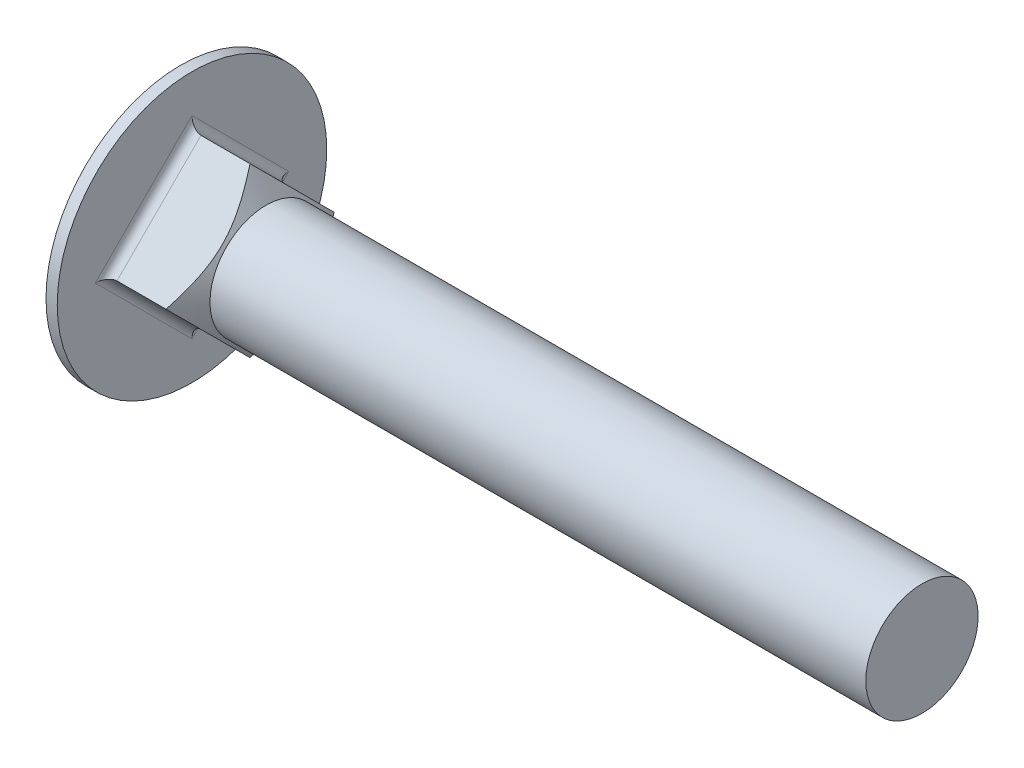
from build123d import *

# Parameters (mm, degrees)
NECK_DEPTH   = 6.6
HEADFILLET_R = 0.8


with BuildPart() as part:
    # Sketch1 → BaseHead (revolve)
    with BuildSketch(Plane.XY):
        with BuildLine():
            Line((4, 12), (5, 12))
            Line((5, 12), (5, 0))
            Line((5, 0), (0, 0))
            ThreePointArc((0, 0), (1.026334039, 6.32455532), (4, 12))
        make_face()
    revolve(axis=Axis((-9.828175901, 0, 0), (1, 0, 0)))

    # Sketch2 → Neck (add)
    with BuildSketch(Plane(origin=(5, 0, 0), x_dir=(0, 0, -1), z_dir=(1, 0, 0))):
        Polygon((-7.481189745, 0), (0, -7.481189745), (7.481189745, 0), (0, 7.481189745), align=None)
    extrude(amount=NECK_DEPTH)

    # Sketch3 → Cut-Revolve1 (revolve, cut)
    with BuildSketch(Plane.XY, mode=Mode.PRIVATE) as cut_revolve1_sk:
        Polygon((11.6, 7.481189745), (10.167484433, 7.481189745), (11.6, 5), align=None)
    revolve(cut_revolve1_sk.sketch.rotate(Axis((5, 0, 0), (1, 0, 0)), 90), axis=Axis((5, 0, 0), (1, 0, 0)), mode=Mode.SUBTRACT)

    # HeadFillet
    headfillet_edges = [part.edges().sort_by_distance(p)[0] for p in [
        (5, 3.740594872, 3.740594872),
        (5, -3.740594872, 3.740594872),
        (5, -3.740594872, -3.740594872),
        (5, 3.740594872, -3.740594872),
    ]]
    fillet(headfillet_edges, radius=HEADFILLET_R)

    # Sketch4 → Revolve1 (revolve)
    with BuildSketch(Plane(origin=(0, 0, 0), x_dir=(1, 0, 0), z_dir=(0, 1, 0)), mode=Mode.PRIVATE) as revolve1_sk:
        Polygon((70, 5), (44, 5), (11.6, 5), (11.6, 0), (70, 0), align=None)
    revolve(revolve1_sk.sketch.rotate(Axis((-12.285447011, 0, 0), (1, 0, 0)), 180), axis=Axis((-12.285447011, 0, 0), (1, 0, 0)))


solid = part.part
